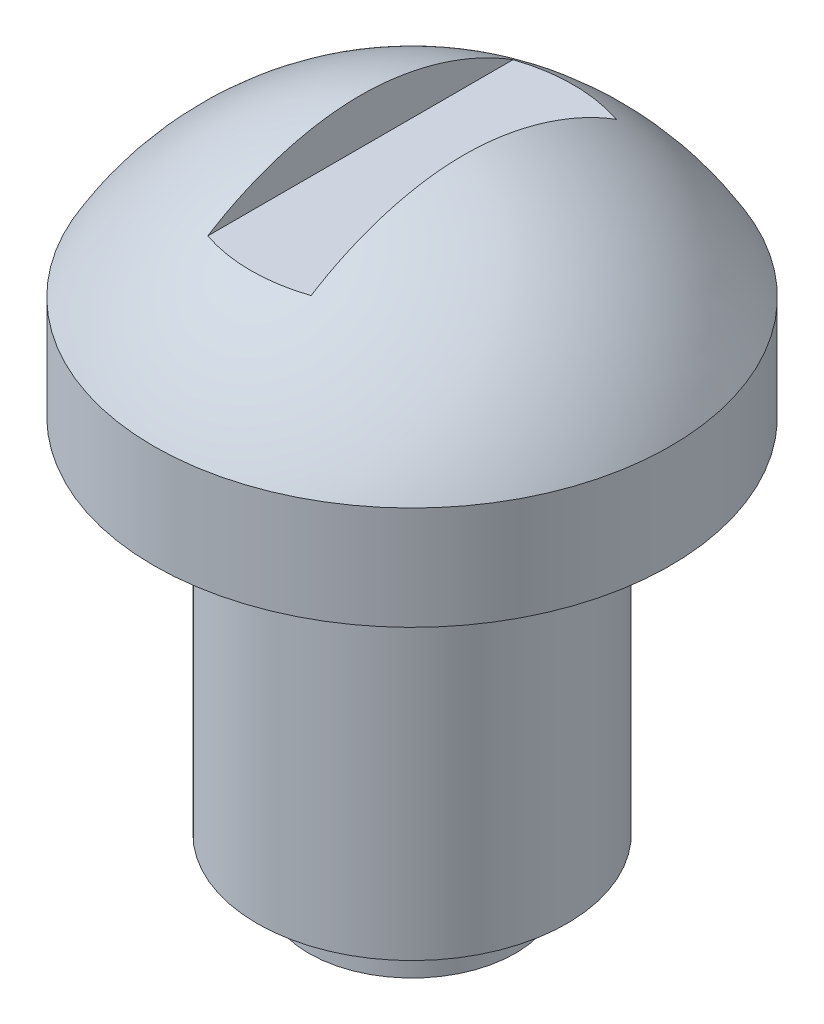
ISO-10303-21;
HEADER;
FILE_DESCRIPTION(('STEP AP214'),'2;1');
FILE_NAME('part.step','',(''),(''),'','','');
FILE_SCHEMA(('AUTOMOTIVE_DESIGN { 1 0 10303 214 1 1 1 1 }'));
ENDSEC;
DATA;
#1=APPLICATION_CONTEXT('core data for automotive mechanical design processes');
#2=APPLICATION_PROTOCOL_DEFINITION('international standard','automotive_design',2000,#1);
#3=PRODUCT_CONTEXT('',#1,'mechanical');
#4=PRODUCT('Part','Part','',(#3));
#5=PRODUCT_RELATED_PRODUCT_CATEGORY('part','',(#4));
#6=PRODUCT_DEFINITION_FORMATION('','',#4);
#7=PRODUCT_DEFINITION_CONTEXT('part definition',#1,'design');
#8=PRODUCT_DEFINITION('design','',#6,#7);
#9=PRODUCT_DEFINITION_SHAPE('','',#8);
#10=(LENGTH_UNIT() NAMED_UNIT(*) SI_UNIT(.MILLI.,.METRE.));
#11=(NAMED_UNIT(*) PLANE_ANGLE_UNIT() SI_UNIT($,.RADIAN.));
#12=(NAMED_UNIT(*) SI_UNIT($,.STERADIAN.) SOLID_ANGLE_UNIT());
#13=UNCERTAINTY_MEASURE_WITH_UNIT(LENGTH_MEASURE(1.E-05),#10,'distance_accuracy_value','');
#14=(GEOMETRIC_REPRESENTATION_CONTEXT(3) GLOBAL_UNCERTAINTY_ASSIGNED_CONTEXT((#13)) GLOBAL_UNIT_ASSIGNED_CONTEXT((#10,
#11,#12)) REPRESENTATION_CONTEXT('',''));
#15=CARTESIAN_POINT('',(0.,0.,0.));
#16=DIRECTION('',(0.,0.,1.));
#17=DIRECTION('',(1.,0.,0.));
#18=AXIS2_PLACEMENT_3D('',#15,#16,#17);
#19=CARTESIAN_POINT('',(0.,0.,0.));
#20=DIRECTION('',(0.,1.,0.));
#21=DIRECTION('',(0.,0.,1.));
#22=AXIS2_PLACEMENT_3D('',#19,#20,#21);
#23=PLANE('',#22);
#24=CARTESIAN_POINT('',(0.,0.,0.));
#25=DIRECTION('',(0.,1.,0.));
#26=DIRECTION('',(0.,0.,1.));
#27=AXIS2_PLACEMENT_3D('',#24,#25,#26);
#28=CIRCLE('',#27,2.);
#29=CARTESIAN_POINT('',(0.,0.,2.));
#30=VERTEX_POINT('',#29);
#31=EDGE_CURVE('E78',#30,#30,#28,.T.);
#32=ORIENTED_EDGE('',*,*,#31,.F.);
#33=EDGE_LOOP('',(#32));
#34=FACE_BOUND('',#33,.T.);
#35=ADVANCED_FACE('F35',(#34),#23,.F.);
#36=CARTESIAN_POINT('',(0.,0.,0.));
#37=DIRECTION('',(0.,1.,0.));
#38=DIRECTION('',(0.,0.,1.));
#39=AXIS2_PLACEMENT_3D('',#36,#37,#38);
#40=CYLINDRICAL_SURFACE('',#39,2.);
#41=CARTESIAN_POINT('',(0.,1.,0.));
#42=DIRECTION('',(0.,1.,0.));
#43=DIRECTION('',(0.,0.,1.));
#44=AXIS2_PLACEMENT_3D('',#41,#42,#43);
#45=CIRCLE('',#44,2.);
#46=CARTESIAN_POINT('',(0.,1.,2.));
#47=VERTEX_POINT('',#46);
#48=EDGE_CURVE('E107',#47,#47,#45,.T.);
#49=ORIENTED_EDGE('',*,*,#48,.F.);
#50=EDGE_LOOP('',(#49));
#51=FACE_BOUND('',#50,.T.);
#52=ORIENTED_EDGE('',*,*,#31,.T.);
#53=EDGE_LOOP('',(#52));
#54=FACE_BOUND('',#53,.T.);
#55=ADVANCED_FACE('F97',(#51,#54),#40,.T.);
#56=CARTESIAN_POINT('',(2.,1.,0.));
#57=DIRECTION('',(0.,1.,0.));
#58=DIRECTION('',(0.,0.,1.));
#59=AXIS2_PLACEMENT_3D('',#56,#57,#58);
#60=PLANE('',#59);
#61=CARTESIAN_POINT('',(0.,1.,0.));
#62=DIRECTION('',(0.,1.,0.));
#63=DIRECTION('',(0.,0.,1.));
#64=AXIS2_PLACEMENT_3D('',#61,#62,#63);
#65=CIRCLE('',#64,3.);
#66=CARTESIAN_POINT('',(0.,1.,3.));
#67=VERTEX_POINT('',#66);
#68=EDGE_CURVE('E109',#67,#67,#65,.T.);
#69=ORIENTED_EDGE('',*,*,#68,.F.);
#70=EDGE_LOOP('',(#69));
#71=FACE_BOUND('',#70,.T.);
#72=ORIENTED_EDGE('',*,*,#48,.T.);
#73=EDGE_LOOP('',(#72));
#74=FACE_BOUND('',#73,.T.);
#75=ADVANCED_FACE('F102',(#71,#74),#60,.F.);
#76=CARTESIAN_POINT('',(0.,0.,0.));
#77=DIRECTION('',(0.,1.,0.));
#78=DIRECTION('',(0.,0.,1.));
#79=AXIS2_PLACEMENT_3D('',#76,#77,#78);
#80=CYLINDRICAL_SURFACE('',#79,3.);
#81=CARTESIAN_POINT('',(0.,8.,0.));
#82=DIRECTION('',(0.,1.,0.));
#83=DIRECTION('',(0.,0.,1.));
#84=AXIS2_PLACEMENT_3D('',#81,#82,#83);
#85=CIRCLE('',#84,3.);
#86=CARTESIAN_POINT('',(0.,8.,3.));
#87=VERTEX_POINT('',#86);
#88=EDGE_CURVE('E114',#87,#87,#85,.T.);
#89=ORIENTED_EDGE('',*,*,#88,.F.);
#90=EDGE_LOOP('',(#89));
#91=FACE_BOUND('',#90,.T.);
#92=ORIENTED_EDGE('',*,*,#68,.T.);
#93=EDGE_LOOP('',(#92));
#94=FACE_BOUND('',#93,.T.);
#95=ADVANCED_FACE('F131',(#91,#94),#80,.T.);
#96=CARTESIAN_POINT('',(3.,8.,0.));
#97=DIRECTION('',(0.,1.,0.));
#98=DIRECTION('',(0.,0.,1.));
#99=AXIS2_PLACEMENT_3D('',#96,#97,#98);
#100=PLANE('',#99);
#101=CARTESIAN_POINT('',(0.,8.,0.));
#102=DIRECTION('',(0.,1.,0.));
#103=DIRECTION('',(0.,0.,1.));
#104=AXIS2_PLACEMENT_3D('',#101,#102,#103);
#105=CIRCLE('',#104,5.);
#106=CARTESIAN_POINT('',(0.,8.,5.));
#107=VERTEX_POINT('',#106);
#108=EDGE_CURVE('E117',#107,#107,#105,.T.);
#109=ORIENTED_EDGE('',*,*,#108,.F.);
#110=EDGE_LOOP('',(#109));
#111=FACE_BOUND('',#110,.T.);
#112=ORIENTED_EDGE('',*,*,#88,.T.);
#113=EDGE_LOOP('',(#112));
#114=FACE_BOUND('',#113,.T.);
#115=ADVANCED_FACE('F126',(#111,#114),#100,.F.);
#116=CARTESIAN_POINT('',(0.,0.,0.));
#117=DIRECTION('',(0.,1.,0.));
#118=DIRECTION('',(0.,0.,1.));
#119=AXIS2_PLACEMENT_3D('',#116,#117,#118);
#120=CYLINDRICAL_SURFACE('',#119,5.);
#121=CARTESIAN_POINT('',(0.,10.,0.));
#122=DIRECTION('',(0.,1.,0.));
#123=DIRECTION('',(0.,0.,1.));
#124=AXIS2_PLACEMENT_3D('',#121,#122,#123);
#125=CIRCLE('',#124,5.);
#126=CARTESIAN_POINT('',(0.,10.,5.));
#127=VERTEX_POINT('',#126);
#128=EDGE_CURVE('E74',#127,#127,#125,.T.);
#129=ORIENTED_EDGE('',*,*,#128,.F.);
#130=EDGE_LOOP('',(#129));
#131=FACE_BOUND('',#130,.T.);
#132=ORIENTED_EDGE('',*,*,#108,.T.);
#133=EDGE_LOOP('',(#132));
#134=FACE_BOUND('',#133,.T.);
#135=ADVANCED_FACE('F95',(#131,#134),#120,.T.);
#136=CARTESIAN_POINT('',(0.,7.00326916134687,0.));
#137=DIRECTION('',(0.,-1.,0.));
#138=DIRECTION('',(0.,0.,-1.));
#139=AXIS2_PLACEMENT_3D('',#136,#137,#138);
#140=DEGENERATE_TOROIDAL_SURFACE('',#139,0.198038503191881,6.,.F.);
#141=CARTESIAN_POINT('',(0.,12.0032691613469,0.));
#142=DIRECTION('',(0.,-1.,0.));
#143=DIRECTION('',(0.,0.,-1.));
#144=AXIS2_PLACEMENT_3D('',#141,#142,#143);
#145=CIRCLE('',#144,3.11858628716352);
#146=CARTESIAN_POINT('',(-1.,12.0032691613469,2.95390934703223));
#147=VERTEX_POINT('',#146);
#148=CARTESIAN_POINT('',(1.,12.0032691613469,2.95390934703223));
#149=VERTEX_POINT('',#148);
#150=EDGE_CURVE('E11',#147,#149,#145,.F.);
#151=ORIENTED_EDGE('',*,*,#150,.F.);
#152=CARTESIAN_POINT('',(-1.,12.8824445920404,0.));
#153=CARTESIAN_POINT('',(-1.,12.8824444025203,0.0847152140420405));
#154=CARTESIAN_POINT('',(-1.,12.8802443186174,0.169431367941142));
#155=CARTESIAN_POINT('',(-1.,12.8715212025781,0.338635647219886));
#156=CARTESIAN_POINT('',(-1.,12.8649979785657,0.423123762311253));
#157=CARTESIAN_POINT('',(-1.,12.8392041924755,0.676049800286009));
#158=CARTESIAN_POINT('',(-1.,12.81370974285,0.843886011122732));
#159=CARTESIAN_POINT('',(-1.,12.7493007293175,1.16718626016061));
#160=CARTESIAN_POINT('',(-1.,12.7112135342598,1.32281841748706));
#161=CARTESIAN_POINT('',(-1.,12.6221265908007,1.630368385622));
#162=CARTESIAN_POINT('',(-1.,12.5711218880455,1.78228474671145));
#163=CARTESIAN_POINT('',(-1.,12.3993728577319,2.23126062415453));
#164=CARTESIAN_POINT('',(-1.,12.2599232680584,2.52140116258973));
#165=CARTESIAN_POINT('',(-1.,11.9339477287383,3.07783725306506));
#166=CARTESIAN_POINT('',(-1.,11.7469395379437,3.34384819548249));
#167=CARTESIAN_POINT('',(-1.,11.3318605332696,3.84147886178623));
#168=CARTESIAN_POINT('',(-1.,11.1038069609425,4.0731129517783));
#169=CARTESIAN_POINT('',(-1.,10.6073283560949,4.50058698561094));
#170=CARTESIAN_POINT('',(-1.,10.3381163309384,4.69551335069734));
#171=CARTESIAN_POINT('',(-1.,9.77079770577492,5.03757140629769));
#172=CARTESIAN_POINT('',(-1.,9.47268567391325,5.18469408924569));
#173=CARTESIAN_POINT('',(-1.,8.85530329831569,5.42727476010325));
#174=CARTESIAN_POINT('',(-1.,8.53598121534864,5.52260078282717));
#175=CARTESIAN_POINT('',(-1.,7.88570515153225,5.65830273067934));
#176=CARTESIAN_POINT('',(-1.,7.55475170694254,5.69868118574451));
#177=CARTESIAN_POINT('',(-1.,7.05698916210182,5.71723650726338));
#178=CARTESIAN_POINT('',(-1.,6.89070763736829,5.71640136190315));
#179=CARTESIAN_POINT('',(-1.,6.55882165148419,5.70073557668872));
#180=CARTESIAN_POINT('',(-1.,6.39321696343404,5.68591009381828));
#181=CARTESIAN_POINT('',(-1.,6.06378661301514,5.64235342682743));
#182=CARTESIAN_POINT('',(-1.,5.89996173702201,5.61361633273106));
#183=CARTESIAN_POINT('',(-1.,5.57537266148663,5.54245436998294));
#184=CARTESIAN_POINT('',(-1.,5.41460735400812,5.50003456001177));
#185=CARTESIAN_POINT('',(-1.,5.09714777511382,5.40178062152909));
#186=CARTESIAN_POINT('',(-1.,4.94045544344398,5.34594022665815));
#187=CARTESIAN_POINT('',(-1.,4.63239141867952,5.22127480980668));
#188=CARTESIAN_POINT('',(-1.,4.48101778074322,5.15245459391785));
#189=CARTESIAN_POINT('',(-1.,4.18457297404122,5.00228575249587));
#190=CARTESIAN_POINT('',(-1.,4.03950329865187,4.9209341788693));
#191=CARTESIAN_POINT('',(-1.,3.75679081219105,4.74632325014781));
#192=CARTESIAN_POINT('',(-1.,3.61914527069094,4.65306831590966));
#193=CARTESIAN_POINT('',(-1.,3.3522152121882,4.45529471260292));
#194=CARTESIAN_POINT('',(-1.,3.22293006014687,4.35077690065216));
#195=CARTESIAN_POINT('',(-1.,2.97368009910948,4.13125199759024));
#196=CARTESIAN_POINT('',(-1.,2.85371184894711,4.01624881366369));
#197=CARTESIAN_POINT('',(-1.,2.6238271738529,3.77645347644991));
#198=CARTESIAN_POINT('',(-1.,2.51391744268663,3.6516549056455));
#199=CARTESIAN_POINT('',(-1.,2.30507379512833,3.39326595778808));
#200=CARTESIAN_POINT('',(-1.,2.20613578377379,3.25967889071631));
#201=CARTESIAN_POINT('',(-1.,2.02003412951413,2.98479173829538));
#202=CARTESIAN_POINT('',(-1.,1.93285544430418,2.8435018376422));
#203=CARTESIAN_POINT('',(-1.,1.77080927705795,2.55409979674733));
#204=CARTESIAN_POINT('',(-1.,1.69593708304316,2.40599029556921));
#205=CARTESIAN_POINT('',(-1.,1.5590522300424,2.10391433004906));
#206=CARTESIAN_POINT('',(-1.,1.49704152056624,1.94994698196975));
#207=CARTESIAN_POINT('',(-1.,1.38646038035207,1.63722122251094));
#208=CARTESIAN_POINT('',(-1.,1.33789225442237,1.47846199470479));
#209=CARTESIAN_POINT('',(-1.,1.25519800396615,1.15867481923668));
#210=CARTESIAN_POINT('',(-1.,1.22095170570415,0.997677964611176));
#211=CARTESIAN_POINT('',(-1.,1.16720810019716,0.673232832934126));
#212=CARTESIAN_POINT('',(-1.,1.14770610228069,0.509785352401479));
#213=CARTESIAN_POINT('',(-1.,1.13050305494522,0.263902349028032));
#214=CARTESIAN_POINT('',(-1.,1.12677602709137,0.181858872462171));
#215=CARTESIAN_POINT('',(-1.,1.12343933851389,0.0176888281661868));
#216=CARTESIAN_POINT('',(-1.,1.12382964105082,-0.0644377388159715));
#217=CARTESIAN_POINT('',(-1.,1.13117783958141,-0.310631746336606));
#218=CARTESIAN_POINT('',(-1.,1.14431037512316,-0.474551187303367));
#219=CARTESIAN_POINT('',(-1.,1.1834498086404,-0.78188229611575));
#220=CARTESIAN_POINT('',(-1.,1.207827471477,-0.92551118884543));
#221=CARTESIAN_POINT('',(-1.,1.26775213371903,-1.21041404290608));
#222=CARTESIAN_POINT('',(-1.,1.30329866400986,-1.3516881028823));
#223=CARTESIAN_POINT('',(-1.,1.38511184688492,-1.63129077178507));
#224=CARTESIAN_POINT('',(-1.,1.43139251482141,-1.769615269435));
#225=CARTESIAN_POINT('',(-1.,1.53423455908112,-2.04238346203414));
#226=CARTESIAN_POINT('',(-1.,1.59079596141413,-2.17682714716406));
#227=CARTESIAN_POINT('',(-1.,1.71932361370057,-2.45295167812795));
#228=CARTESIAN_POINT('',(-1.,1.79221580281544,-2.59420244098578));
#229=CARTESIAN_POINT('',(-1.,1.94924070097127,-2.87037584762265));
#230=CARTESIAN_POINT('',(-1.,2.03337758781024,-3.00529611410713));
#231=CARTESIAN_POINT('',(-1.,2.21221225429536,-3.26776765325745));
#232=CARTESIAN_POINT('',(-1.,2.30690041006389,-3.39532548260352));
#233=CARTESIAN_POINT('',(-1.,2.50630018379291,-3.64242532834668));
#234=CARTESIAN_POINT('',(-1.,2.6110154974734,-3.76196436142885));
#235=CARTESIAN_POINT('',(-1.,2.83416039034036,-3.99684693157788));
#236=CARTESIAN_POINT('',(-1.,2.95297255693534,-4.11182732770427));
#237=CARTESIAN_POINT('',(-1.,3.19986738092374,-4.33145883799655));
#238=CARTESIAN_POINT('',(-1.,3.32795355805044,-4.4361059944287));
#239=CARTESIAN_POINT('',(-1.,3.59245187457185,-4.63429076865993));
#240=CARTESIAN_POINT('',(-1.,3.72886406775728,-4.72782831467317));
#241=CARTESIAN_POINT('',(-1.,4.00910184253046,-4.90316978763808));
#242=CARTESIAN_POINT('',(-1.,4.15293015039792,-4.98496935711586));
#243=CARTESIAN_POINT('',(-1.,4.44750752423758,-5.13651256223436));
#244=CARTESIAN_POINT('',(-1.,4.59828117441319,-5.20620841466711));
#245=CARTESIAN_POINT('',(-1.,4.90521575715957,-5.33268683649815));
#246=CARTESIAN_POINT('',(-1.,5.06137865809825,-5.38946462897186));
#247=CARTESIAN_POINT('',(-1.,5.37785719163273,-5.48964948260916));
#248=CARTESIAN_POINT('',(-1.,5.53817088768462,-5.53306266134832));
#249=CARTESIAN_POINT('',(-1.,5.861938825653,-5.60625938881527));
#250=CARTESIAN_POINT('',(-1.,6.02539414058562,-5.63603819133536));
#251=CARTESIAN_POINT('',(-1.,6.35435871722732,-5.68175099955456));
#252=CARTESIAN_POINT('',(-1.,6.5198694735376,-5.69767425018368));
#253=CARTESIAN_POINT('',(-1.,6.85164404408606,-5.71552388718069));
#254=CARTESIAN_POINT('',(-1.,7.01790785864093,-5.71745026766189));
#255=CARTESIAN_POINT('',(-1.,7.35003894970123,-5.70729151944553));
#256=CARTESIAN_POINT('',(-1.,7.51590614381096,-5.69520369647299));
#257=CARTESIAN_POINT('',(-1.,7.84597511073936,-5.65710445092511));
#258=CARTESIAN_POINT('',(-1.,8.01017744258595,-5.63109787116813));
#259=CARTESIAN_POINT('',(-1.,8.33588954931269,-5.56533199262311));
#260=CARTESIAN_POINT('',(-1.,8.49739794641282,-5.52556586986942));
#261=CARTESIAN_POINT('',(-1.,8.81643061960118,-5.43258266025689));
#262=CARTESIAN_POINT('',(-1.,8.97395634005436,-5.37937052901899));
#263=CARTESIAN_POINT('',(-1.,9.28403227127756,-5.25983909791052));
#264=CARTESIAN_POINT('',(-1.,9.436580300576,-5.19351413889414));
#265=CARTESIAN_POINT('',(-1.,9.73548754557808,-5.04826866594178));
#266=CARTESIAN_POINT('',(-1.,9.88184902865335,-4.96935281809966));
#267=CARTESIAN_POINT('',(-1.,10.1674393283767,-4.79944382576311));
#268=CARTESIAN_POINT('',(-1.,10.306666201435,-4.70844741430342));
#269=CARTESIAN_POINT('',(-1.,10.5769008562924,-4.5150743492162));
#270=CARTESIAN_POINT('',(-1.,10.7079116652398,-4.41270192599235));
#271=CARTESIAN_POINT('',(-1.,10.9608430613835,-4.19726618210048));
#272=CARTESIAN_POINT('',(-1.,11.0827630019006,-4.08420210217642));
#273=CARTESIAN_POINT('',(-1.,11.316583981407,-3.8482330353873));
#274=CARTESIAN_POINT('',(-1.,11.4284887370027,-3.72533173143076));
#275=CARTESIAN_POINT('',(-1.,11.6414066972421,-3.4706586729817));
#276=CARTESIAN_POINT('',(-1.,11.7424316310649,-3.33889672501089));
#277=CARTESIAN_POINT('',(-1.,11.9329571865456,-3.06736210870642));
#278=CARTESIAN_POINT('',(-1.,12.0224621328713,-2.92759247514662));
#279=CARTESIAN_POINT('',(-1.,12.1894449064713,-2.64077164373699));
#280=CARTESIAN_POINT('',(-1.,12.2669051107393,-2.49371018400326));
#281=CARTESIAN_POINT('',(-1.,12.4090278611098,-2.19353250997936));
#282=CARTESIAN_POINT('',(-1.,12.4736909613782,-2.04041655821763));
#283=CARTESIAN_POINT('',(-1.,12.5878263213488,-1.73407724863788));
#284=CARTESIAN_POINT('',(-1.,12.6377111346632,-1.5810076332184));
#285=CARTESIAN_POINT('',(-1.,12.7243849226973,-1.271174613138));
#286=CARTESIAN_POINT('',(-1.,12.7611717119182,-1.11441059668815));
#287=CARTESIAN_POINT('',(-1.,12.820802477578,-0.798698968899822));
#288=CARTESIAN_POINT('',(-1.,12.8436887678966,-0.639759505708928));
#289=CARTESIAN_POINT('',(-1.,12.8668198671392,-0.400349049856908));
#290=CARTESIAN_POINT('',(-1.,12.8726638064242,-0.32039092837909));
#291=CARTESIAN_POINT('',(-1.,12.8804760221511,-0.1602888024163));
#292=CARTESIAN_POINT('',(-1.,12.8824447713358,-0.0801448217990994));
#293=CARTESIAN_POINT('',(-1.,12.8824445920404,0.));
#294=B_SPLINE_CURVE_WITH_KNOTS('',3,(#152,#153,#154,#155,#156,#157,#158,#159,#160,#161,#162,
#163,#164,#165,#166,#167,#168,#169,#170,#171,#172,#173,#174,#175,#176,#177,#178,#179,#180,#181,
#182,#183,#184,#185,#186,#187,#188,#189,#190,#191,#192,#193,#194,#195,#196,#197,#198,#199,#200,
#201,#202,#203,#204,#205,#206,#207,#208,#209,#210,#211,#212,#213,#214,#215,#216,#217,#218,#219,
#220,#221,#222,#223,#224,#225,#226,#227,#228,#229,#230,#231,#232,#233,#234,#235,#236,#237,#238,
#239,#240,#241,#242,#243,#244,#245,#246,#247,#248,#249,#250,#251,#252,#253,#254,#255,#256,#257,
#258,#259,#260,#261,#262,#263,#264,#265,#266,#267,#268,#269,#270,#271,#272,#273,#274,#275,#276,
#277,#278,#279,#280,#281,#282,#283,#284,#285,#286,#287,#288,#289,#290,#291,#292,#293),
.UNSPECIFIED.,.T.,.F.,(4,2,2,2,2,2,2,2,2,2,2,2,2,2,2,2,2,2,2,2,2,2,2,2,2,2,2,2,2,2,2,2,2,2,2,2,
2,2,2,2,2,2,2,2,2,2,2,2,2,2,2,2,2,2,2,2,2,2,2,2,2,2,2,2,2,2,2,2,2,2,4),(0.,0.254116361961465,
0.508244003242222,1.01668865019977,1.49678878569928,1.9770733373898,2.93808324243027,
3.90925590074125,4.88002155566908,5.87243907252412,6.86504348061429,7.86016508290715,
8.85524086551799,9.35360700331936,9.85178950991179,10.3501838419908,10.8483941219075,
11.3468374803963,11.845096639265,12.3434731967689,12.8416651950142,13.3398193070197,
13.8377885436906,14.3360867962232,14.8341984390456,15.3316667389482,15.8289441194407,
16.3262968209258,16.8237347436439,17.3169106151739,17.8099295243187,18.0562229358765,
18.3025141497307,18.7949837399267,19.2315947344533,19.6681873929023,20.1053533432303,
20.5425203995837,21.0188367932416,21.495330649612,21.9713933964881,22.4476322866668,
22.9430608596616,23.4386784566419,23.9342992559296,24.4301035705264,24.927822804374,
25.425725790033,25.9234005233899,26.421248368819,26.9194823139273,27.4177164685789,
27.9160464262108,28.4142031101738,28.9126072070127,29.4108278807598,29.9092640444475,
30.4075159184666,30.9059028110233,31.4041049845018,31.9023425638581,32.4003944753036,
32.8979039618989,33.395226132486,33.8932692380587,34.3912907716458,34.8737050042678,
35.3561996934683,35.8372181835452,36.0776542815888,36.3180610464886),.UNSPECIFIED.);
#295=CARTESIAN_POINT('',(-1.,12.0032691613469,-2.95390934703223));
#296=VERTEX_POINT('',#295);
#297=EDGE_CURVE('E38',#296,#147,#294,.T.);
#298=ORIENTED_EDGE('',*,*,#297,.F.);
#299=CARTESIAN_POINT('',(1.,12.0032691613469,-2.95390934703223));
#300=VERTEX_POINT('',#299);
#301=EDGE_CURVE('E48',#300,#296,#145,.F.);
#302=ORIENTED_EDGE('',*,*,#301,.F.);
#303=CARTESIAN_POINT('',(1.,12.8824445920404,0.));
#304=CARTESIAN_POINT('',(1.,12.8824444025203,-0.0847152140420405));
#305=CARTESIAN_POINT('',(1.,12.8802443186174,-0.169431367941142));
#306=CARTESIAN_POINT('',(1.,12.8715212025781,-0.338635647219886));
#307=CARTESIAN_POINT('',(1.,12.8649979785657,-0.423123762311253));
#308=CARTESIAN_POINT('',(1.,12.8392041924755,-0.676049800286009));
#309=CARTESIAN_POINT('',(1.,12.81370974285,-0.843886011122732));
#310=CARTESIAN_POINT('',(1.,12.7493007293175,-1.16718626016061));
#311=CARTESIAN_POINT('',(1.,12.7112135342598,-1.32281841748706));
#312=CARTESIAN_POINT('',(1.,12.6221265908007,-1.630368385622));
#313=CARTESIAN_POINT('',(1.,12.5711218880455,-1.78228474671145));
#314=CARTESIAN_POINT('',(1.,12.3993728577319,-2.23126062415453));
#315=CARTESIAN_POINT('',(1.,12.2599232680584,-2.52140116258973));
#316=CARTESIAN_POINT('',(1.,11.9339477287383,-3.07783725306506));
#317=CARTESIAN_POINT('',(1.,11.7469395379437,-3.34384819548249));
#318=CARTESIAN_POINT('',(1.,11.3318605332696,-3.84147886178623));
#319=CARTESIAN_POINT('',(1.,11.1038069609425,-4.0731129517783));
#320=CARTESIAN_POINT('',(1.,10.6073283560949,-4.50058698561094));
#321=CARTESIAN_POINT('',(1.,10.3381163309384,-4.69551335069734));
#322=CARTESIAN_POINT('',(1.,9.77079770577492,-5.03757140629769));
#323=CARTESIAN_POINT('',(1.,9.47268567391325,-5.18469408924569));
#324=CARTESIAN_POINT('',(1.,8.85530329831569,-5.42727476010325));
#325=CARTESIAN_POINT('',(1.,8.53598121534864,-5.52260078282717));
#326=CARTESIAN_POINT('',(1.,7.88570515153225,-5.65830273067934));
#327=CARTESIAN_POINT('',(1.,7.55475170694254,-5.69868118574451));
#328=CARTESIAN_POINT('',(1.,7.05698916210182,-5.71723650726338));
#329=CARTESIAN_POINT('',(1.,6.89070763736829,-5.71640136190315));
#330=CARTESIAN_POINT('',(1.,6.55882165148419,-5.70073557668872));
#331=CARTESIAN_POINT('',(1.,6.39321696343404,-5.68591009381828));
#332=CARTESIAN_POINT('',(1.,6.06378661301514,-5.64235342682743));
#333=CARTESIAN_POINT('',(1.,5.89996173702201,-5.61361633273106));
#334=CARTESIAN_POINT('',(1.,5.57537266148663,-5.54245436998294));
#335=CARTESIAN_POINT('',(1.,5.41460735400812,-5.50003456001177));
#336=CARTESIAN_POINT('',(1.,5.09714777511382,-5.40178062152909));
#337=CARTESIAN_POINT('',(1.,4.94045544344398,-5.34594022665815));
#338=CARTESIAN_POINT('',(1.,4.63239141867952,-5.22127480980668));
#339=CARTESIAN_POINT('',(1.,4.48101778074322,-5.15245459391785));
#340=CARTESIAN_POINT('',(1.,4.18457297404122,-5.00228575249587));
#341=CARTESIAN_POINT('',(1.,4.03950329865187,-4.9209341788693));
#342=CARTESIAN_POINT('',(1.,3.75679081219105,-4.74632325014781));
#343=CARTESIAN_POINT('',(1.,3.61914527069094,-4.65306831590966));
#344=CARTESIAN_POINT('',(1.,3.3522152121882,-4.45529471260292));
#345=CARTESIAN_POINT('',(1.,3.22293006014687,-4.35077690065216));
#346=CARTESIAN_POINT('',(1.,2.97368009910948,-4.13125199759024));
#347=CARTESIAN_POINT('',(1.,2.85371184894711,-4.01624881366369));
#348=CARTESIAN_POINT('',(1.,2.6238271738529,-3.77645347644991));
#349=CARTESIAN_POINT('',(1.,2.51391744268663,-3.6516549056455));
#350=CARTESIAN_POINT('',(1.,2.30507379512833,-3.39326595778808));
#351=CARTESIAN_POINT('',(1.,2.20613578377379,-3.25967889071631));
#352=CARTESIAN_POINT('',(1.,2.02003412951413,-2.98479173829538));
#353=CARTESIAN_POINT('',(1.,1.93285544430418,-2.8435018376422));
#354=CARTESIAN_POINT('',(1.,1.77080927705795,-2.55409979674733));
#355=CARTESIAN_POINT('',(1.,1.69593708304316,-2.40599029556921));
#356=CARTESIAN_POINT('',(1.,1.5590522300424,-2.10391433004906));
#357=CARTESIAN_POINT('',(1.,1.49704152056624,-1.94994698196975));
#358=CARTESIAN_POINT('',(1.,1.38646038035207,-1.63722122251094));
#359=CARTESIAN_POINT('',(1.,1.33789225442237,-1.47846199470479));
#360=CARTESIAN_POINT('',(1.,1.25519800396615,-1.15867481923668));
#361=CARTESIAN_POINT('',(1.,1.22095170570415,-0.997677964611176));
#362=CARTESIAN_POINT('',(1.,1.16720810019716,-0.673232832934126));
#363=CARTESIAN_POINT('',(1.,1.14770610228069,-0.509785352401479));
#364=CARTESIAN_POINT('',(1.,1.13050305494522,-0.263902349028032));
#365=CARTESIAN_POINT('',(1.,1.12677602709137,-0.181858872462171));
#366=CARTESIAN_POINT('',(1.,1.12343933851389,-0.0176888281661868));
#367=CARTESIAN_POINT('',(1.,1.12382964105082,0.0644377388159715));
#368=CARTESIAN_POINT('',(1.,1.13117783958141,0.310631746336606));
#369=CARTESIAN_POINT('',(1.,1.14431037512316,0.474551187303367));
#370=CARTESIAN_POINT('',(1.,1.1834498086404,0.78188229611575));
#371=CARTESIAN_POINT('',(1.,1.207827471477,0.92551118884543));
#372=CARTESIAN_POINT('',(1.,1.26775213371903,1.21041404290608));
#373=CARTESIAN_POINT('',(1.,1.30329866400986,1.3516881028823));
#374=CARTESIAN_POINT('',(1.,1.38511184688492,1.63129077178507));
#375=CARTESIAN_POINT('',(1.,1.43139251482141,1.769615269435));
#376=CARTESIAN_POINT('',(1.,1.53423455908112,2.04238346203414));
#377=CARTESIAN_POINT('',(1.,1.59079596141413,2.17682714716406));
#378=CARTESIAN_POINT('',(1.,1.71932361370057,2.45295167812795));
#379=CARTESIAN_POINT('',(1.,1.79221580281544,2.59420244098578));
#380=CARTESIAN_POINT('',(1.,1.94924070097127,2.87037584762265));
#381=CARTESIAN_POINT('',(1.,2.03337758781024,3.00529611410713));
#382=CARTESIAN_POINT('',(1.,2.21221225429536,3.26776765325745));
#383=CARTESIAN_POINT('',(1.,2.30690041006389,3.39532548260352));
#384=CARTESIAN_POINT('',(1.,2.50630018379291,3.64242532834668));
#385=CARTESIAN_POINT('',(1.,2.6110154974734,3.76196436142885));
#386=CARTESIAN_POINT('',(1.,2.83416039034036,3.99684693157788));
#387=CARTESIAN_POINT('',(1.,2.95297255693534,4.11182732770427));
#388=CARTESIAN_POINT('',(1.,3.19986738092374,4.33145883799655));
#389=CARTESIAN_POINT('',(1.,3.32795355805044,4.4361059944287));
#390=CARTESIAN_POINT('',(1.,3.59245187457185,4.63429076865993));
#391=CARTESIAN_POINT('',(1.,3.72886406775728,4.72782831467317));
#392=CARTESIAN_POINT('',(1.,4.00910184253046,4.90316978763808));
#393=CARTESIAN_POINT('',(1.,4.15293015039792,4.98496935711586));
#394=CARTESIAN_POINT('',(1.,4.44750752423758,5.13651256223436));
#395=CARTESIAN_POINT('',(1.,4.59828117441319,5.20620841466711));
#396=CARTESIAN_POINT('',(1.,4.90521575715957,5.33268683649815));
#397=CARTESIAN_POINT('',(1.,5.06137865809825,5.38946462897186));
#398=CARTESIAN_POINT('',(1.,5.37785719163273,5.48964948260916));
#399=CARTESIAN_POINT('',(1.,5.53817088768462,5.53306266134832));
#400=CARTESIAN_POINT('',(1.,5.861938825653,5.60625938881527));
#401=CARTESIAN_POINT('',(1.,6.02539414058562,5.63603819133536));
#402=CARTESIAN_POINT('',(1.,6.35435871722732,5.68175099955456));
#403=CARTESIAN_POINT('',(1.,6.5198694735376,5.69767425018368));
#404=CARTESIAN_POINT('',(1.,6.85164404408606,5.71552388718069));
#405=CARTESIAN_POINT('',(1.,7.01790785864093,5.71745026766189));
#406=CARTESIAN_POINT('',(1.,7.35003894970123,5.70729151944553));
#407=CARTESIAN_POINT('',(1.,7.51590614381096,5.69520369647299));
#408=CARTESIAN_POINT('',(1.,7.84597511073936,5.65710445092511));
#409=CARTESIAN_POINT('',(1.,8.01017744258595,5.63109787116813));
#410=CARTESIAN_POINT('',(1.,8.33588954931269,5.56533199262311));
#411=CARTESIAN_POINT('',(1.,8.49739794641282,5.52556586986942));
#412=CARTESIAN_POINT('',(1.,8.81643061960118,5.43258266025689));
#413=CARTESIAN_POINT('',(1.,8.97395634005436,5.37937052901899));
#414=CARTESIAN_POINT('',(1.,9.28403227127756,5.25983909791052));
#415=CARTESIAN_POINT('',(1.,9.436580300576,5.19351413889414));
#416=CARTESIAN_POINT('',(1.,9.73548754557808,5.04826866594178));
#417=CARTESIAN_POINT('',(1.,9.88184902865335,4.96935281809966));
#418=CARTESIAN_POINT('',(1.,10.1674393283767,4.79944382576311));
#419=CARTESIAN_POINT('',(1.,10.306666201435,4.70844741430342));
#420=CARTESIAN_POINT('',(1.,10.5769008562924,4.5150743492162));
#421=CARTESIAN_POINT('',(1.,10.7079116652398,4.41270192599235));
#422=CARTESIAN_POINT('',(1.,10.9608430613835,4.19726618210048));
#423=CARTESIAN_POINT('',(1.,11.0827630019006,4.08420210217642));
#424=CARTESIAN_POINT('',(1.,11.316583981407,3.8482330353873));
#425=CARTESIAN_POINT('',(1.,11.4284887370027,3.72533173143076));
#426=CARTESIAN_POINT('',(1.,11.6414066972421,3.4706586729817));
#427=CARTESIAN_POINT('',(1.,11.7424316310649,3.33889672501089));
#428=CARTESIAN_POINT('',(1.,11.9329571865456,3.06736210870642));
#429=CARTESIAN_POINT('',(1.,12.0224621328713,2.92759247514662));
#430=CARTESIAN_POINT('',(1.,12.1894449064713,2.64077164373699));
#431=CARTESIAN_POINT('',(1.,12.2669051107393,2.49371018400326));
#432=CARTESIAN_POINT('',(1.,12.4090278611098,2.19353250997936));
#433=CARTESIAN_POINT('',(1.,12.4736909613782,2.04041655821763));
#434=CARTESIAN_POINT('',(1.,12.5878263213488,1.73407724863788));
#435=CARTESIAN_POINT('',(1.,12.6377111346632,1.5810076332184));
#436=CARTESIAN_POINT('',(1.,12.7243849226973,1.271174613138));
#437=CARTESIAN_POINT('',(1.,12.7611717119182,1.11441059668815));
#438=CARTESIAN_POINT('',(1.,12.820802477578,0.798698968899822));
#439=CARTESIAN_POINT('',(1.,12.8436887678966,0.639759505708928));
#440=CARTESIAN_POINT('',(1.,12.8668198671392,0.400349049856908));
#441=CARTESIAN_POINT('',(1.,12.8726638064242,0.32039092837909));
#442=CARTESIAN_POINT('',(1.,12.8804760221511,0.1602888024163));
#443=CARTESIAN_POINT('',(1.,12.8824447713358,0.0801448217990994));
#444=CARTESIAN_POINT('',(1.,12.8824445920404,0.));
#445=B_SPLINE_CURVE_WITH_KNOTS('',3,(#303,#304,#305,#306,#307,#308,#309,#310,#311,#312,#313,
#314,#315,#316,#317,#318,#319,#320,#321,#322,#323,#324,#325,#326,#327,#328,#329,#330,#331,#332,
#333,#334,#335,#336,#337,#338,#339,#340,#341,#342,#343,#344,#345,#346,#347,#348,#349,#350,#351,
#352,#353,#354,#355,#356,#357,#358,#359,#360,#361,#362,#363,#364,#365,#366,#367,#368,#369,#370,
#371,#372,#373,#374,#375,#376,#377,#378,#379,#380,#381,#382,#383,#384,#385,#386,#387,#388,#389,
#390,#391,#392,#393,#394,#395,#396,#397,#398,#399,#400,#401,#402,#403,#404,#405,#406,#407,#408,
#409,#410,#411,#412,#413,#414,#415,#416,#417,#418,#419,#420,#421,#422,#423,#424,#425,#426,#427,
#428,#429,#430,#431,#432,#433,#434,#435,#436,#437,#438,#439,#440,#441,#442,#443,#444),
.UNSPECIFIED.,.T.,.F.,(4,2,2,2,2,2,2,2,2,2,2,2,2,2,2,2,2,2,2,2,2,2,2,2,2,2,2,2,2,2,2,2,2,2,2,2,
2,2,2,2,2,2,2,2,2,2,2,2,2,2,2,2,2,2,2,2,2,2,2,2,2,2,2,2,2,2,2,2,2,2,4),(0.,0.254116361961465,
0.508244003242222,1.01668865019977,1.49678878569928,1.9770733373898,2.93808324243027,
3.90925590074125,4.88002155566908,5.87243907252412,6.86504348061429,7.86016508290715,
8.85524086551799,9.35360700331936,9.85178950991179,10.3501838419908,10.8483941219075,
11.3468374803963,11.845096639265,12.3434731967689,12.8416651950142,13.3398193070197,
13.8377885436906,14.3360867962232,14.8341984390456,15.3316667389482,15.8289441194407,
16.3262968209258,16.8237347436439,17.3169106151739,17.8099295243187,18.0562229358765,
18.3025141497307,18.7949837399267,19.2315947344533,19.6681873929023,20.1053533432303,
20.5425203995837,21.0188367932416,21.495330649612,21.9713933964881,22.4476322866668,
22.9430608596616,23.4386784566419,23.9342992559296,24.4301035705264,24.927822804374,
25.425725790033,25.9234005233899,26.421248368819,26.9194823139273,27.4177164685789,
27.9160464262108,28.4142031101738,28.9126072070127,29.4108278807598,29.9092640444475,
30.4075159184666,30.9059028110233,31.4041049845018,31.9023425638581,32.4003944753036,
32.8979039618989,33.395226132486,33.8932692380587,34.3912907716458,34.8737050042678,
35.3561996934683,35.8372181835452,36.0776542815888,36.3180610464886),.UNSPECIFIED.);
#446=EDGE_CURVE('E72',#149,#300,#445,.T.);
#447=ORIENTED_EDGE('',*,*,#446,.F.);
#448=EDGE_LOOP('',(#151,#298,#302,#447));
#449=FACE_BOUND('',#448,.T.);
#450=ORIENTED_EDGE('',*,*,#128,.T.);
#451=EDGE_LOOP('',(#450));
#452=FACE_BOUND('',#451,.T.);
#453=ADVANCED_FACE('F76',(#449,#452),#140,.F.);
#454=CARTESIAN_POINT('',(-1.,12.0032691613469,-5.));
#455=DIRECTION('',(-1.,0.,0.));
#456=DIRECTION('',(0.,0.,1.));
#457=AXIS2_PLACEMENT_3D('',#454,#455,#456);
#458=PLANE('',#457);
#459=ORIENTED_EDGE('',*,*,#297,.T.);
#460=DIRECTION('',(0.,0.,1.));
#461=VECTOR('',#460,1.);
#462=CARTESIAN_POINT('',(-1.,12.0032691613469,-5.));
#463=LINE('',#462,#461);
#464=EDGE_CURVE('E67',#296,#147,#463,.T.);
#465=ORIENTED_EDGE('',*,*,#464,.F.);
#466=EDGE_LOOP('',(#459,#465));
#467=FACE_BOUND('',#466,.T.);
#468=ADVANCED_FACE('F88',(#467),#458,.F.);
#469=CARTESIAN_POINT('',(1.,12.0032691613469,-5.));
#470=DIRECTION('',(1.,0.,0.));
#471=DIRECTION('',(0.,0.,-1.));
#472=AXIS2_PLACEMENT_3D('',#469,#470,#471);
#473=PLANE('',#472);
#474=ORIENTED_EDGE('',*,*,#446,.T.);
#475=DIRECTION('',(0.,0.,1.));
#476=VECTOR('',#475,1.);
#477=CARTESIAN_POINT('',(1.,12.0032691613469,-5.));
#478=LINE('',#477,#476);
#479=EDGE_CURVE('E54',#300,#149,#478,.T.);
#480=ORIENTED_EDGE('',*,*,#479,.T.);
#481=EDGE_LOOP('',(#474,#480));
#482=FACE_BOUND('',#481,.T.);
#483=ADVANCED_FACE('F71',(#482),#473,.F.);
#484=CARTESIAN_POINT('',(1.,12.0032691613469,-5.));
#485=DIRECTION('',(0.,-1.,0.));
#486=DIRECTION('',(0.,0.,-1.));
#487=AXIS2_PLACEMENT_3D('',#484,#485,#486);
#488=PLANE('',#487);
#489=ORIENTED_EDGE('',*,*,#150,.T.);
#490=ORIENTED_EDGE('',*,*,#479,.F.);
#491=ORIENTED_EDGE('',*,*,#301,.T.);
#492=ORIENTED_EDGE('',*,*,#464,.T.);
#493=EDGE_LOOP('',(#489,#490,#491,#492));
#494=FACE_BOUND('',#493,.T.);
#495=ADVANCED_FACE('F66',(#494),#488,.F.);
#496=CLOSED_SHELL('',(#35,#55,#75,#95,#115,#135,#453,#468,#483,#495));
#497=MANIFOLD_SOLID_BREP('B2',#496);
#498=ADVANCED_BREP_SHAPE_REPRESENTATION('',(#18,#497),#14);
#499=SHAPE_DEFINITION_REPRESENTATION(#9,#498);
ENDSEC;
END-ISO-10303-21;
